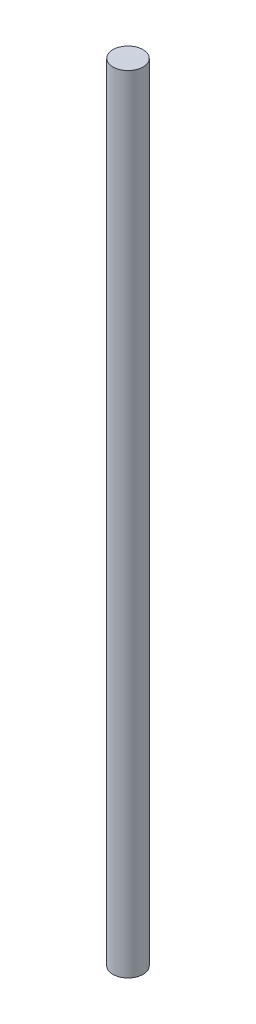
from build123d import *

# Parameters (mm, degrees)
ESQUISSE1_R        = 2
BOSS_EXTRU_1_DEPTH = 52.25


with BuildPart() as part:
    # Esquisse1 → Boss.-Extru.1 (new, symmetric)
    with BuildSketch(Plane(origin=(0, 0, 0), x_dir=(1, 0, 0), z_dir=(0, 1, 0))):
        with Locations(Location((0, 0, 0), (0, 0, 270))):
            Circle(ESQUISSE1_R)
    extrude(amount=BOSS_EXTRU_1_DEPTH, both=True)


solid = part.part
